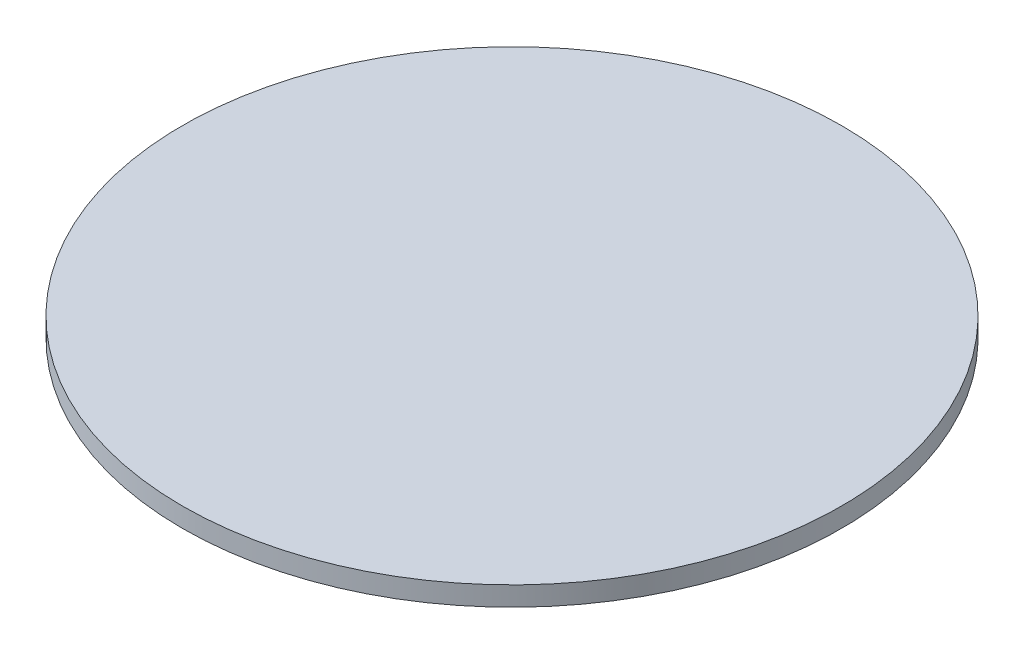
from build123d import *

# Parameters (mm, degrees)
SKETCH1_R           = 85
BOSS_EXTRUDE1_DEPTH = 5


with BuildPart() as part:
    # Sketch1 → Boss-Extrude1 (new body)
    with BuildSketch(Plane(origin=(0, 0, 0), x_dir=(1, 0, 0), z_dir=(0, 1, 0))):
        with Locations(Location((0, 0, 0), (0, 0, 270))):
            Circle(SKETCH1_R)
    extrude(amount=BOSS_EXTRUDE1_DEPTH)


solid = part.part
